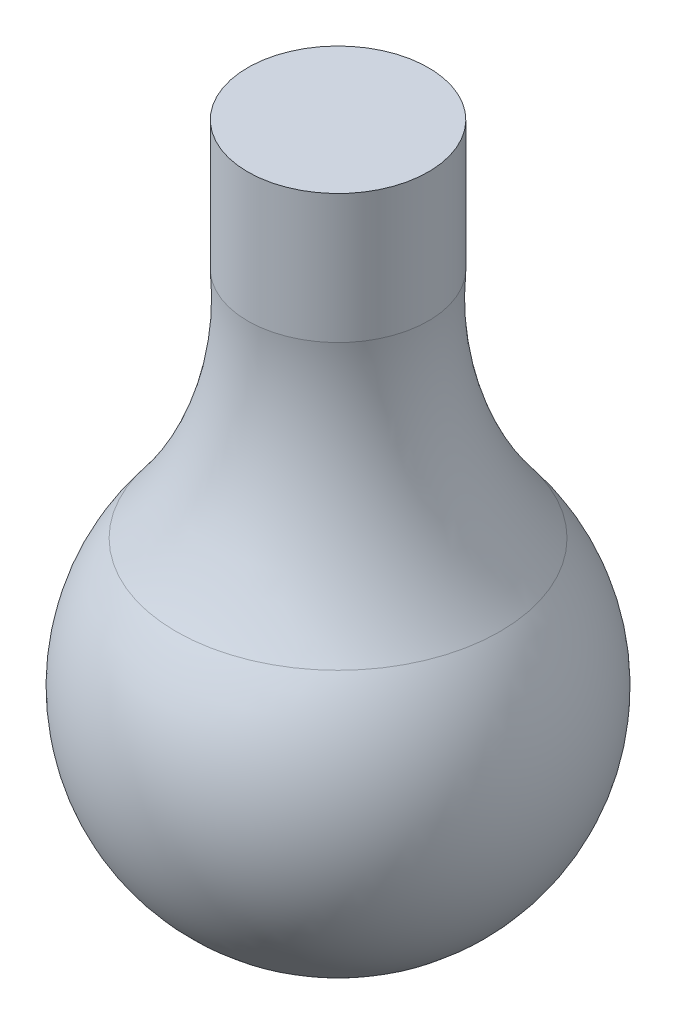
ISO-10303-21;
HEADER;
FILE_DESCRIPTION(('STEP AP214'),'2;1');
FILE_NAME('part.step','',(''),(''),'','','');
FILE_SCHEMA(('AUTOMOTIVE_DESIGN { 1 0 10303 214 1 1 1 1 }'));
ENDSEC;
DATA;
#1=APPLICATION_CONTEXT('core data for automotive mechanical design processes');
#2=APPLICATION_PROTOCOL_DEFINITION('international standard','automotive_design',2000,#1);
#3=PRODUCT_CONTEXT('',#1,'mechanical');
#4=PRODUCT('Part','Part','',(#3));
#5=PRODUCT_RELATED_PRODUCT_CATEGORY('part','',(#4));
#6=PRODUCT_DEFINITION_FORMATION('','',#4);
#7=PRODUCT_DEFINITION_CONTEXT('part definition',#1,'design');
#8=PRODUCT_DEFINITION('design','',#6,#7);
#9=PRODUCT_DEFINITION_SHAPE('','',#8);
#10=(LENGTH_UNIT() NAMED_UNIT(*) SI_UNIT(.MILLI.,.METRE.));
#11=(NAMED_UNIT(*) PLANE_ANGLE_UNIT() SI_UNIT($,.RADIAN.));
#12=(NAMED_UNIT(*) SI_UNIT($,.STERADIAN.) SOLID_ANGLE_UNIT());
#13=UNCERTAINTY_MEASURE_WITH_UNIT(LENGTH_MEASURE(1.E-05),#10,'distance_accuracy_value','');
#14=(GEOMETRIC_REPRESENTATION_CONTEXT(3) GLOBAL_UNCERTAINTY_ASSIGNED_CONTEXT((#13)) GLOBAL_UNIT_ASSIGNED_CONTEXT((#10,
#11,#12)) REPRESENTATION_CONTEXT('',''));
#15=CARTESIAN_POINT('',(0.,0.,0.));
#16=DIRECTION('',(0.,0.,1.));
#17=DIRECTION('',(1.,0.,0.));
#18=AXIS2_PLACEMENT_3D('',#15,#16,#17);
#19=CARTESIAN_POINT('',(0.,-0.964261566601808,0.));
#20=DIRECTION('',(0.,1.,0.));
#21=DIRECTION('',(0.,0.,1.));
#22=AXIS2_PLACEMENT_3D('',#19,#20,#21);
#23=TOROIDAL_SURFACE('',#22,16.4641891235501,13.);
#24=CARTESIAN_POINT('',(0.,0.,0.));
#25=DIRECTION('',(0.,1.,0.));
#26=DIRECTION('',(0.,0.,1.));
#27=AXIS2_PLACEMENT_3D('',#24,#25,#26);
#28=CIRCLE('',#27,3.5);
#29=CARTESIAN_POINT('',(0.,0.,3.5));
#30=VERTEX_POINT('',#29);
#31=EDGE_CURVE('E11',#30,#30,#28,.T.);
#32=ORIENTED_EDGE('',*,*,#31,.F.);
#33=EDGE_LOOP('',(#32));
#34=FACE_BOUND('',#33,.T.);
#35=CARTESIAN_POINT('',(0.,-9.0340044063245,0.));
#36=DIRECTION('',(0.,1.,0.));
#37=DIRECTION('',(0.,0.,1.));
#38=AXIS2_PLACEMENT_3D('',#35,#36,#37);
#39=CIRCLE('',#38,6.2720720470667);
#40=CARTESIAN_POINT('',(0.,-9.0340044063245,6.2720720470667));
#41=VERTEX_POINT('',#40);
#42=EDGE_CURVE('E44',#41,#41,#39,.T.);
#43=ORIENTED_EDGE('',*,*,#42,.T.);
#44=EDGE_LOOP('',(#43));
#45=FACE_BOUND('',#44,.T.);
#46=ADVANCED_FACE('F38',(#34,#45),#23,.F.);
#47=CARTESIAN_POINT('',(3.5,0.,0.));
#48=DIRECTION('',(0.,-1.,0.));
#49=DIRECTION('',(0.,0.,-1.));
#50=AXIS2_PLACEMENT_3D('',#47,#48,#49);
#51=PLANE('',#50);
#52=ORIENTED_EDGE('',*,*,#31,.T.);
#53=EDGE_LOOP('',(#52));
#54=FACE_BOUND('',#53,.T.);
#55=ADVANCED_FACE('F53',(#54),#51,.F.);
#56=CARTESIAN_POINT('',(0.,-14.,0.));
#57=DIRECTION('',(0.,1.,0.));
#58=DIRECTION('',(1.,0.,0.));
#59=AXIS2_PLACEMENT_3D('',#56,#57,#58);
#60=SPHERICAL_SURFACE('',#59,8.);
#61=ORIENTED_EDGE('',*,*,#42,.F.);
#62=EDGE_LOOP('',(#61));
#63=FACE_BOUND('',#62,.T.);
#64=ADVANCED_FACE('F51',(#63),#60,.T.);
#65=CLOSED_SHELL('',(#46,#55,#64));
#66=MANIFOLD_SOLID_BREP('B2',#65);
#67=CARTESIAN_POINT('',(0.,5.,0.));
#68=DIRECTION('',(0.,-1.,0.));
#69=DIRECTION('',(0.,0.,-1.));
#70=AXIS2_PLACEMENT_3D('',#67,#68,#69);
#71=CYLINDRICAL_SURFACE('',#70,3.5);
#72=CARTESIAN_POINT('',(0.,5.,0.));
#73=DIRECTION('',(0.,1.,0.));
#74=DIRECTION('',(0.,0.,1.));
#75=AXIS2_PLACEMENT_3D('',#72,#73,#74);
#76=CIRCLE('',#75,3.5);
#77=CARTESIAN_POINT('',(0.,5.,3.5));
#78=VERTEX_POINT('',#77);
#79=EDGE_CURVE('E37',#78,#78,#76,.T.);
#80=ORIENTED_EDGE('',*,*,#79,.F.);
#81=EDGE_LOOP('',(#80));
#82=FACE_BOUND('',#81,.T.);
#83=CARTESIAN_POINT('',(0.,0.,0.));
#84=DIRECTION('',(0.,1.,0.));
#85=DIRECTION('',(0.,0.,1.));
#86=AXIS2_PLACEMENT_3D('',#83,#84,#85);
#87=CIRCLE('',#86,3.5);
#88=CARTESIAN_POINT('',(0.,0.,3.5));
#89=VERTEX_POINT('',#88);
#90=EDGE_CURVE('E81',#89,#89,#87,.T.);
#91=ORIENTED_EDGE('',*,*,#90,.T.);
#92=EDGE_LOOP('',(#91));
#93=FACE_BOUND('',#92,.T.);
#94=ADVANCED_FACE('F78',(#82,#93),#71,.T.);
#95=CARTESIAN_POINT('',(0.,5.,0.));
#96=DIRECTION('',(0.,1.,0.));
#97=DIRECTION('',(0.,0.,1.));
#98=AXIS2_PLACEMENT_3D('',#95,#96,#97);
#99=PLANE('',#98);
#100=ORIENTED_EDGE('',*,*,#79,.T.);
#101=EDGE_LOOP('',(#100));
#102=FACE_BOUND('',#101,.T.);
#103=ADVANCED_FACE('F93',(#102),#99,.T.);
#104=CARTESIAN_POINT('',(0.,0.,0.));
#105=DIRECTION('',(0.,1.,0.));
#106=DIRECTION('',(0.,0.,1.));
#107=AXIS2_PLACEMENT_3D('',#104,#105,#106);
#108=PLANE('',#107);
#109=ORIENTED_EDGE('',*,*,#90,.F.);
#110=EDGE_LOOP('',(#109));
#111=FACE_BOUND('',#110,.T.);
#112=ADVANCED_FACE('F91',(#111),#108,.F.);
#113=CLOSED_SHELL('',(#94,#103,#112));
#114=MANIFOLD_SOLID_BREP('B6',#113);
#115=ADVANCED_BREP_SHAPE_REPRESENTATION('',(#18,#66,#114),#14);
#116=SHAPE_DEFINITION_REPRESENTATION(#9,#115);
ENDSEC;
END-ISO-10303-21;
